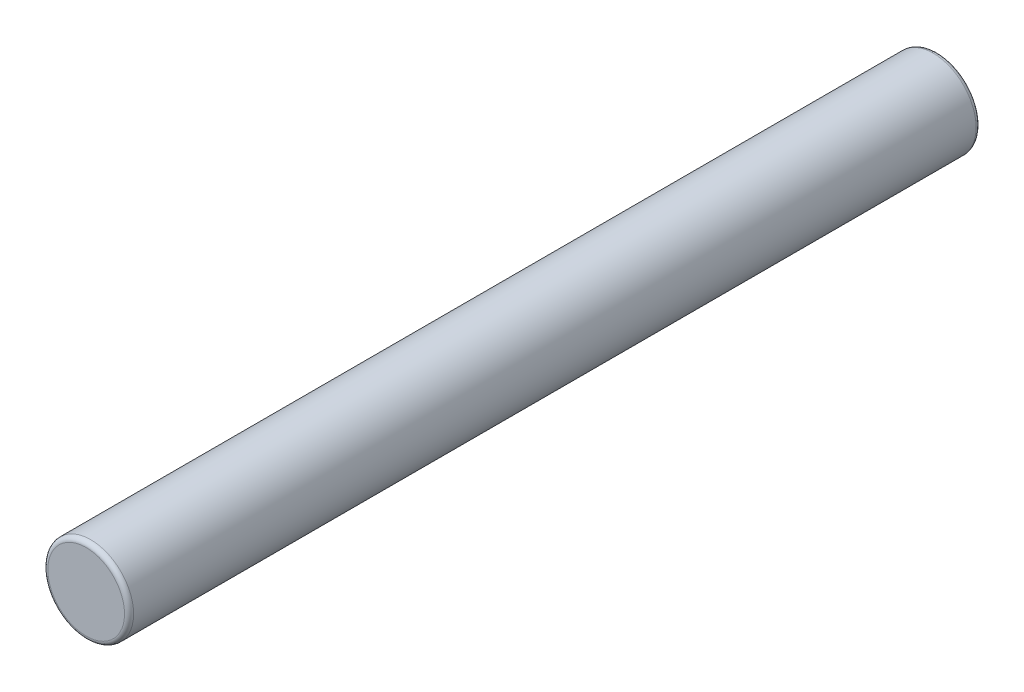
from build123d import *

# Parameters (mm, degrees)
SKETCH1_R      = 1.20015
EXTRUDE1_DEPTH = 11.9126
FILLET1_R      = 0.127


with BuildPart() as part:
    # Sketch1 → Extrude1 (new, symmetric)
    with BuildSketch(Plane.XY):
        Circle(SKETCH1_R)
    extrude(amount=EXTRUDE1_DEPTH, both=True)

    # Fillet1
    fillet1_edges = [part.edges().sort_by_distance(p)[0] for p in [
        (-1.20015, 0, -11.9126),
        (-1.20015, 0, 11.9126),
    ]]
    fillet(fillet1_edges, radius=FILLET1_R)


solid = part.part
